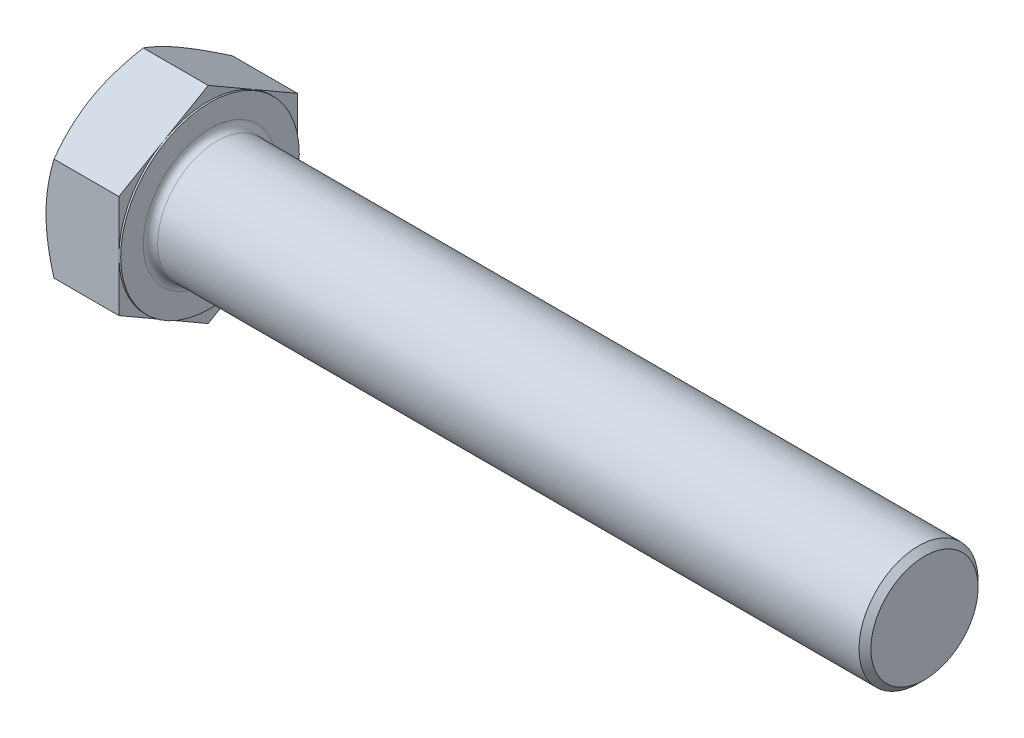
from build123d import *

# Parameters (mm, degrees)
BASEHEAD_DEPTH = 15.9258
SKETCH4_W      = 0.381
SKETCH4_H      = 28.347045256
HEADFILLET_R   = 1.524


with BuildPart() as part:
    # Sketch1 → BaseHead (new body)
    with BuildSketch(Plane(origin=(0, 0, 0), x_dir=(0, 0, -1), z_dir=(1, 0, 0))):
        Polygon((19.05, 10.998522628), (19.05, -10.998522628), (0, -21.997045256), (-19.05, -10.998522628), (-19.05, 10.998522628), (0, 21.997045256), align=None)
    extrude(amount=BASEHEAD_DEPTH)

    # BodySke → BaseBody (revolve)
    with BuildSketch(Plane.XY, mode=Mode.PRIVATE) as basebody_sk:
        Polygon((0, 0), (168.3258, 0), (168.3258, 11.43127), (167.05707, 12.7), (0, 12.7), align=None)
    revolve(basebody_sk.sketch.rotate(Axis((0, 0, 0), (1, 0, 0)), 90), axis=Axis((0, 0, 0), (1, 0, 0)))

    # Sketch3 → HeadChamfer (revolve, cut)
    with BuildSketch(Plane.XY):
        Polygon((0, 19.05), (5.367651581, 28.347045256), (5.367651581, 34.697045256), (-12.7, 34.697045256), (-12.7, 19.05), align=None)
    revolve(axis=Axis((0, 0, 0), (1, 0, 0)), mode=Mode.SUBTRACT)

    # Sketch4 → BearingFace (revolve, cut)
    with BuildSketch(Plane.XY, mode=Mode.PRIVATE) as bearingface_sk:
        with Locations((15.7353, 33.223522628)):
            Rectangle(SKETCH4_W, SKETCH4_H)
    revolve(bearingface_sk.sketch.rotate(Axis((0, 0, 0), (1, 0, 0)), 270), axis=Axis((0, 0, 0), (1, 0, 0)), mode=Mode.SUBTRACT)

    # HeadFillet
    headfillet_edges = [part.edges().sort_by_distance(p)[0] for p in [
        (15.9258, 0, -12.7),
    ]]
    fillet(headfillet_edges, radius=HEADFILLET_R)


solid = part.part
